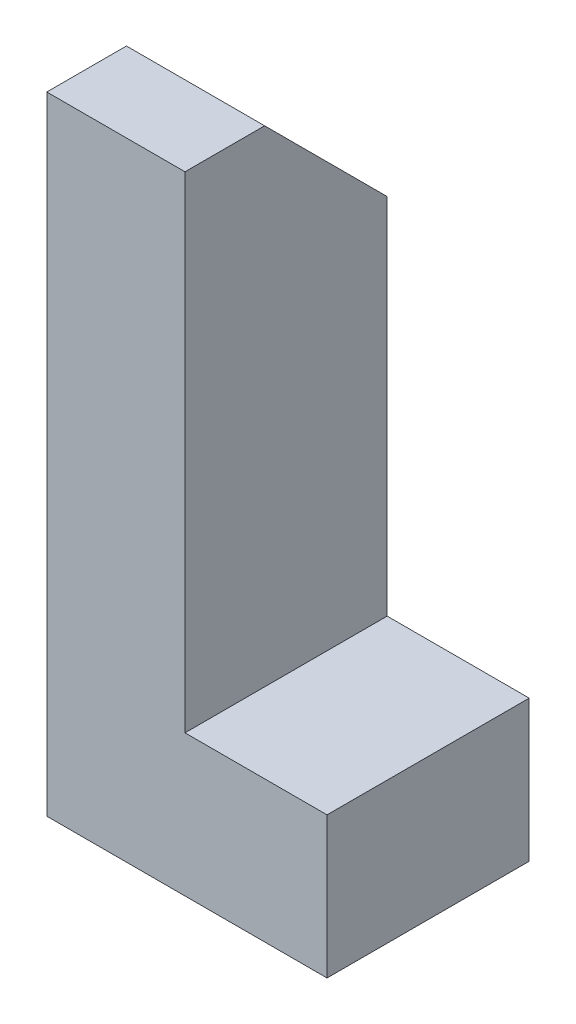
ISO-10303-21;
HEADER;
FILE_DESCRIPTION(('STEP AP214'),'2;1');
FILE_NAME('part.step','',(''),(''),'','','');
FILE_SCHEMA(('AUTOMOTIVE_DESIGN { 1 0 10303 214 1 1 1 1 }'));
ENDSEC;
DATA;
#1=APPLICATION_CONTEXT('core data for automotive mechanical design processes');
#2=APPLICATION_PROTOCOL_DEFINITION('international standard','automotive_design',2000,#1);
#3=PRODUCT_CONTEXT('',#1,'mechanical');
#4=PRODUCT('Part','Part','',(#3));
#5=PRODUCT_RELATED_PRODUCT_CATEGORY('part','',(#4));
#6=PRODUCT_DEFINITION_FORMATION('','',#4);
#7=PRODUCT_DEFINITION_CONTEXT('part definition',#1,'design');
#8=PRODUCT_DEFINITION('design','',#6,#7);
#9=PRODUCT_DEFINITION_SHAPE('','',#8);
#10=(LENGTH_UNIT() NAMED_UNIT(*) SI_UNIT(.MILLI.,.METRE.));
#11=(NAMED_UNIT(*) PLANE_ANGLE_UNIT() SI_UNIT($,.RADIAN.));
#12=(NAMED_UNIT(*) SI_UNIT($,.STERADIAN.) SOLID_ANGLE_UNIT());
#13=UNCERTAINTY_MEASURE_WITH_UNIT(LENGTH_MEASURE(1.E-05),#10,'distance_accuracy_value','');
#14=(GEOMETRIC_REPRESENTATION_CONTEXT(3) GLOBAL_UNCERTAINTY_ASSIGNED_CONTEXT((#13)) GLOBAL_UNIT_ASSIGNED_CONTEXT((#10,
#11,#12)) REPRESENTATION_CONTEXT('',''));
#15=CARTESIAN_POINT('',(0.,0.,0.));
#16=DIRECTION('',(0.,0.,1.));
#17=DIRECTION('',(1.,0.,0.));
#18=AXIS2_PLACEMENT_3D('',#15,#16,#17);
#19=CARTESIAN_POINT('',(-34.8579529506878,0.,25.146));
#20=DIRECTION('',(0.,1.,0.));
#21=DIRECTION('',(0.,0.,1.));
#22=AXIS2_PLACEMENT_3D('',#19,#20,#21);
#23=PLANE('',#22);
#24=DIRECTION('',(1.,0.,0.));
#25=VECTOR('',#24,1.);
#26=CARTESIAN_POINT('',(-34.8579529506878,0.,0.));
#27=LINE('',#26,#25);
#28=CARTESIAN_POINT('',(-34.8579529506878,0.,0.));
#29=VERTEX_POINT('',#28);
#30=CARTESIAN_POINT('',(0.,0.,0.));
#31=VERTEX_POINT('',#30);
#32=EDGE_CURVE('E112',#29,#31,#27,.T.);
#33=ORIENTED_EDGE('',*,*,#32,.T.);
#34=DIRECTION('',(0.,0.,-1.));
#35=VECTOR('',#34,1.);
#36=CARTESIAN_POINT('',(0.,0.,25.146));
#37=LINE('',#36,#35);
#38=CARTESIAN_POINT('',(0.,0.,25.146));
#39=VERTEX_POINT('',#38);
#40=EDGE_CURVE('E93',#39,#31,#37,.T.);
#41=ORIENTED_EDGE('',*,*,#40,.F.);
#42=DIRECTION('',(1.,0.,0.));
#43=VECTOR('',#42,1.);
#44=CARTESIAN_POINT('',(-34.8579529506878,0.,25.146));
#45=LINE('',#44,#43);
#46=CARTESIAN_POINT('',(-34.8579529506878,0.,25.146));
#47=VERTEX_POINT('',#46);
#48=EDGE_CURVE('E100',#47,#39,#45,.T.);
#49=ORIENTED_EDGE('',*,*,#48,.F.);
#50=DIRECTION('',(0.,0.,-1.));
#51=VECTOR('',#50,1.);
#52=CARTESIAN_POINT('',(-34.8579529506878,0.,25.146));
#53=LINE('',#52,#51);
#54=EDGE_CURVE('E128',#47,#29,#53,.T.);
#55=ORIENTED_EDGE('',*,*,#54,.T.);
#56=EDGE_LOOP('',(#33,#41,#49,#55));
#57=FACE_BOUND('',#56,.T.);
#58=ADVANCED_FACE('F31',(#57),#23,.F.);
#59=CARTESIAN_POINT('',(0.,0.,25.146));
#60=DIRECTION('',(-1.,0.,0.));
#61=DIRECTION('',(0.,0.,1.));
#62=AXIS2_PLACEMENT_3D('',#59,#60,#61);
#63=PLANE('',#62);
#64=DIRECTION('',(0.,1.,0.));
#65=VECTOR('',#64,1.);
#66=CARTESIAN_POINT('',(0.,0.,0.));
#67=LINE('',#66,#65);
#68=CARTESIAN_POINT('',(0.,17.5754617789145,0.));
#69=VERTEX_POINT('',#68);
#70=EDGE_CURVE('E135',#31,#69,#67,.T.);
#71=ORIENTED_EDGE('',*,*,#70,.T.);
#72=DIRECTION('',(0.,0.,-1.));
#73=VECTOR('',#72,1.);
#74=CARTESIAN_POINT('',(0.,17.5754617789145,25.146));
#75=LINE('',#74,#73);
#76=CARTESIAN_POINT('',(0.,17.5754617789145,25.146));
#77=VERTEX_POINT('',#76);
#78=EDGE_CURVE('E96',#77,#69,#75,.T.);
#79=ORIENTED_EDGE('',*,*,#78,.F.);
#80=DIRECTION('',(0.,1.,0.));
#81=VECTOR('',#80,1.);
#82=CARTESIAN_POINT('',(0.,0.,25.146));
#83=LINE('',#82,#81);
#84=EDGE_CURVE('E89',#39,#77,#83,.T.);
#85=ORIENTED_EDGE('',*,*,#84,.F.);
#86=ORIENTED_EDGE('',*,*,#40,.T.);
#87=EDGE_LOOP('',(#71,#79,#85,#86));
#88=FACE_BOUND('',#87,.T.);
#89=ADVANCED_FACE('F91',(#88),#63,.F.);
#90=CARTESIAN_POINT('',(0.,17.5754617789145,25.146));
#91=DIRECTION('',(0.,-1.,0.));
#92=DIRECTION('',(0.,0.,-1.));
#93=AXIS2_PLACEMENT_3D('',#90,#91,#92);
#94=PLANE('',#93);
#95=DIRECTION('',(-1.,0.,0.));
#96=VECTOR('',#95,1.);
#97=CARTESIAN_POINT('',(0.,17.5754617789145,0.));
#98=LINE('',#97,#96);
#99=CARTESIAN_POINT('',(-17.6686169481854,17.5754617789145,0.));
#100=VERTEX_POINT('',#99);
#101=EDGE_CURVE('E133',#69,#100,#98,.T.);
#102=ORIENTED_EDGE('',*,*,#101,.T.);
#103=DIRECTION('',(0.,0.,-1.));
#104=VECTOR('',#103,1.);
#105=CARTESIAN_POINT('',(-17.6686169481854,17.5754617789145,25.146));
#106=LINE('',#105,#104);
#107=CARTESIAN_POINT('',(-17.6686169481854,17.5754617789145,25.146));
#108=VERTEX_POINT('',#107);
#109=EDGE_CURVE('E117',#108,#100,#106,.T.);
#110=ORIENTED_EDGE('',*,*,#109,.F.);
#111=DIRECTION('',(-1.,0.,0.));
#112=VECTOR('',#111,1.);
#113=CARTESIAN_POINT('',(0.,17.5754617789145,25.146));
#114=LINE('',#113,#112);
#115=EDGE_CURVE('E99',#77,#108,#114,.T.);
#116=ORIENTED_EDGE('',*,*,#115,.F.);
#117=ORIENTED_EDGE('',*,*,#78,.T.);
#118=EDGE_LOOP('',(#102,#110,#116,#117));
#119=FACE_BOUND('',#118,.T.);
#120=ADVANCED_FACE('F147',(#119),#94,.F.);
#121=CARTESIAN_POINT('',(-17.6686169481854,17.5754617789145,25.146));
#122=DIRECTION('',(-1.,0.,0.));
#123=DIRECTION('',(0.,0.,1.));
#124=AXIS2_PLACEMENT_3D('',#121,#122,#123);
#125=PLANE('',#124);
#126=DIRECTION('',(0.,1.,0.));
#127=VECTOR('',#126,1.);
#128=CARTESIAN_POINT('',(-17.6686169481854,17.5754617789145,0.));
#129=LINE('',#128,#127);
#130=CARTESIAN_POINT('',(-17.6686169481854,62.7748195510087,0.));
#131=VERTEX_POINT('',#130);
#132=EDGE_CURVE('E131',#100,#131,#129,.T.);
#133=ORIENTED_EDGE('',*,*,#132,.T.);
#134=DIRECTION('',(0.,-0.707106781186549,-0.707106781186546));
#135=VECTOR('',#134,1.);
#136=CARTESIAN_POINT('',(-17.6686169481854,78.0148195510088,15.24));
#137=LINE('',#136,#135);
#138=CARTESIAN_POINT('',(-17.6686169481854,78.0148195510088,15.24));
#139=VERTEX_POINT('',#138);
#140=EDGE_CURVE('E11',#131,#139,#137,.F.);
#141=ORIENTED_EDGE('',*,*,#140,.T.);
#142=DIRECTION('',(0.,0.,-1.));
#143=VECTOR('',#142,1.);
#144=CARTESIAN_POINT('',(-17.6686169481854,78.0148195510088,25.146));
#145=LINE('',#144,#143);
#146=CARTESIAN_POINT('',(-17.6686169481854,78.0148195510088,25.146));
#147=VERTEX_POINT('',#146);
#148=EDGE_CURVE('E123',#147,#139,#145,.T.);
#149=ORIENTED_EDGE('',*,*,#148,.F.);
#150=DIRECTION('',(0.,1.,0.));
#151=VECTOR('',#150,1.);
#152=CARTESIAN_POINT('',(-17.6686169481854,17.5754617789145,25.146));
#153=LINE('',#152,#151);
#154=EDGE_CURVE('E141',#108,#147,#153,.T.);
#155=ORIENTED_EDGE('',*,*,#154,.F.);
#156=ORIENTED_EDGE('',*,*,#109,.T.);
#157=EDGE_LOOP('',(#133,#141,#149,#155,#156));
#158=FACE_BOUND('',#157,.T.);
#159=ADVANCED_FACE('F150',(#158),#125,.F.);
#160=CARTESIAN_POINT('',(-17.6686169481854,78.0148195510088,25.146));
#161=DIRECTION('',(0.,-1.,0.));
#162=DIRECTION('',(0.,0.,-1.));
#163=AXIS2_PLACEMENT_3D('',#160,#161,#162);
#164=PLANE('',#163);
#165=ORIENTED_EDGE('',*,*,#148,.T.);
#166=DIRECTION('',(-1.,0.,0.));
#167=VECTOR('',#166,1.);
#168=CARTESIAN_POINT('',(-17.6686169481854,78.0148195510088,15.24));
#169=LINE('',#168,#167);
#170=CARTESIAN_POINT('',(-34.8579529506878,78.0148195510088,15.24));
#171=VERTEX_POINT('',#170);
#172=EDGE_CURVE('E113',#139,#171,#169,.T.);
#173=ORIENTED_EDGE('',*,*,#172,.T.);
#174=DIRECTION('',(0.,0.,-1.));
#175=VECTOR('',#174,1.);
#176=CARTESIAN_POINT('',(-34.8579529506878,78.0148195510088,25.146));
#177=LINE('',#176,#175);
#178=CARTESIAN_POINT('',(-34.8579529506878,78.0148195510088,25.146));
#179=VERTEX_POINT('',#178);
#180=EDGE_CURVE('E126',#179,#171,#177,.T.);
#181=ORIENTED_EDGE('',*,*,#180,.F.);
#182=DIRECTION('',(-1.,0.,0.));
#183=VECTOR('',#182,1.);
#184=CARTESIAN_POINT('',(-17.6686169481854,78.0148195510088,25.146));
#185=LINE('',#184,#183);
#186=EDGE_CURVE('E139',#147,#179,#185,.T.);
#187=ORIENTED_EDGE('',*,*,#186,.F.);
#188=EDGE_LOOP('',(#165,#173,#181,#187));
#189=FACE_BOUND('',#188,.T.);
#190=ADVANCED_FACE('F156',(#189),#164,.F.);
#191=CARTESIAN_POINT('',(-34.8579529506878,78.0148195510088,25.146));
#192=DIRECTION('',(1.,0.,0.));
#193=DIRECTION('',(0.,1.,0.));
#194=AXIS2_PLACEMENT_3D('',#191,#192,#193);
#195=PLANE('',#194);
#196=ORIENTED_EDGE('',*,*,#180,.T.);
#197=DIRECTION('',(0.,0.707106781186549,0.707106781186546));
#198=VECTOR('',#197,1.);
#199=CARTESIAN_POINT('',(-34.8579529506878,78.0148195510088,15.24));
#200=LINE('',#199,#198);
#201=CARTESIAN_POINT('',(-34.8579529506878,62.7748195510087,0.));
#202=VERTEX_POINT('',#201);
#203=EDGE_CURVE('E53',#171,#202,#200,.F.);
#204=ORIENTED_EDGE('',*,*,#203,.T.);
#205=DIRECTION('',(0.,-1.,0.));
#206=VECTOR('',#205,1.);
#207=CARTESIAN_POINT('',(-34.8579529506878,78.0148195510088,0.));
#208=LINE('',#207,#206);
#209=EDGE_CURVE('E109',#202,#29,#208,.T.);
#210=ORIENTED_EDGE('',*,*,#209,.T.);
#211=ORIENTED_EDGE('',*,*,#54,.F.);
#212=DIRECTION('',(0.,-1.,0.));
#213=VECTOR('',#212,1.);
#214=CARTESIAN_POINT('',(-34.8579529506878,78.0148195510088,25.146));
#215=LINE('',#214,#213);
#216=EDGE_CURVE('E105',#179,#47,#215,.T.);
#217=ORIENTED_EDGE('',*,*,#216,.F.);
#218=EDGE_LOOP('',(#196,#204,#210,#211,#217));
#219=FACE_BOUND('',#218,.T.);
#220=ADVANCED_FACE('F157',(#219),#195,.F.);
#221=CARTESIAN_POINT('',(0.,0.,25.146));
#222=DIRECTION('',(0.,0.,1.));
#223=DIRECTION('',(1.,0.,0.));
#224=AXIS2_PLACEMENT_3D('',#221,#222,#223);
#225=PLANE('',#224);
#226=ORIENTED_EDGE('',*,*,#48,.T.);
#227=ORIENTED_EDGE('',*,*,#84,.T.);
#228=ORIENTED_EDGE('',*,*,#115,.T.);
#229=ORIENTED_EDGE('',*,*,#154,.T.);
#230=ORIENTED_EDGE('',*,*,#186,.T.);
#231=ORIENTED_EDGE('',*,*,#216,.T.);
#232=EDGE_LOOP('',(#226,#227,#228,#229,#230,#231));
#233=FACE_BOUND('',#232,.T.);
#234=ADVANCED_FACE('F103',(#233),#225,.T.);
#235=CARTESIAN_POINT('',(0.,0.,0.));
#236=DIRECTION('',(0.,0.,1.));
#237=DIRECTION('',(1.,0.,0.));
#238=AXIS2_PLACEMENT_3D('',#235,#236,#237);
#239=PLANE('',#238);
#240=ORIENTED_EDGE('',*,*,#209,.F.);
#241=DIRECTION('',(1.,0.,0.));
#242=VECTOR('',#241,1.);
#243=CARTESIAN_POINT('',(0.,62.7748195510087,0.));
#244=LINE('',#243,#242);
#245=EDGE_CURVE('E39',#202,#131,#244,.T.);
#246=ORIENTED_EDGE('',*,*,#245,.T.);
#247=ORIENTED_EDGE('',*,*,#132,.F.);
#248=ORIENTED_EDGE('',*,*,#101,.F.);
#249=ORIENTED_EDGE('',*,*,#70,.F.);
#250=ORIENTED_EDGE('',*,*,#32,.F.);
#251=EDGE_LOOP('',(#240,#246,#247,#248,#249,#250));
#252=FACE_BOUND('',#251,.T.);
#253=ADVANCED_FACE('F158',(#252),#239,.F.);
#254=CARTESIAN_POINT('',(-17.6686169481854,78.0148195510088,15.24));
#255=DIRECTION('',(0.,-0.707106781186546,0.707106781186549));
#256=DIRECTION('',(0.,-0.707106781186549,-0.707106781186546));
#257=AXIS2_PLACEMENT_3D('',#254,#255,#256);
#258=PLANE('',#257);
#259=ORIENTED_EDGE('',*,*,#140,.F.);
#260=ORIENTED_EDGE('',*,*,#245,.F.);
#261=ORIENTED_EDGE('',*,*,#203,.F.);
#262=ORIENTED_EDGE('',*,*,#172,.F.);
#263=EDGE_LOOP('',(#259,#260,#261,#262));
#264=FACE_BOUND('',#263,.T.);
#265=ADVANCED_FACE('F33',(#264),#258,.F.);
#266=CLOSED_SHELL('',(#58,#89,#120,#159,#190,#220,#234,#253,#265));
#267=MANIFOLD_SOLID_BREP('B2',#266);
#268=ADVANCED_BREP_SHAPE_REPRESENTATION('',(#18,#267),#14);
#269=SHAPE_DEFINITION_REPRESENTATION(#9,#268);
ENDSEC;
END-ISO-10303-21;
